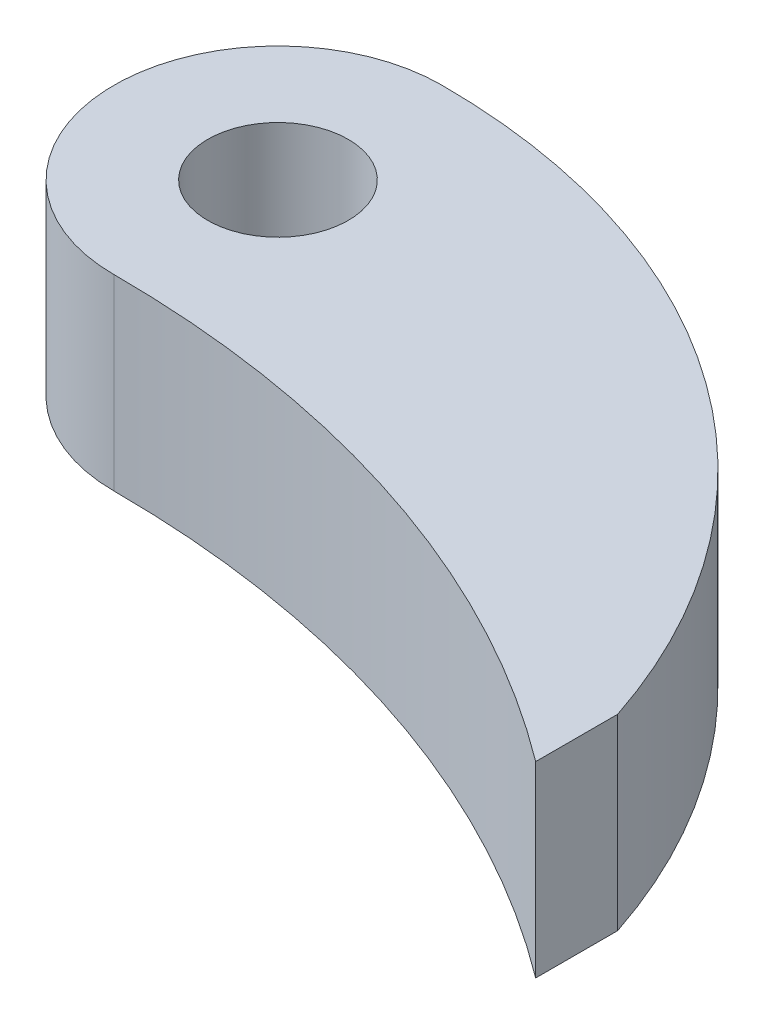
ISO-10303-21;
HEADER;
FILE_DESCRIPTION(('STEP AP214'),'2;1');
FILE_NAME('part.step','',(''),(''),'','','');
FILE_SCHEMA(('AUTOMOTIVE_DESIGN { 1 0 10303 214 1 1 1 1 }'));
ENDSEC;
DATA;
#1=APPLICATION_CONTEXT('core data for automotive mechanical design processes');
#2=APPLICATION_PROTOCOL_DEFINITION('international standard','automotive_design',2000,#1);
#3=PRODUCT_CONTEXT('',#1,'mechanical');
#4=PRODUCT('Part','Part','',(#3));
#5=PRODUCT_RELATED_PRODUCT_CATEGORY('part','',(#4));
#6=PRODUCT_DEFINITION_FORMATION('','',#4);
#7=PRODUCT_DEFINITION_CONTEXT('part definition',#1,'design');
#8=PRODUCT_DEFINITION('design','',#6,#7);
#9=PRODUCT_DEFINITION_SHAPE('','',#8);
#10=(LENGTH_UNIT() NAMED_UNIT(*) SI_UNIT(.MILLI.,.METRE.));
#11=(NAMED_UNIT(*) PLANE_ANGLE_UNIT() SI_UNIT($,.RADIAN.));
#12=(NAMED_UNIT(*) SI_UNIT($,.STERADIAN.) SOLID_ANGLE_UNIT());
#13=UNCERTAINTY_MEASURE_WITH_UNIT(LENGTH_MEASURE(1.E-05),#10,'distance_accuracy_value','');
#14=(GEOMETRIC_REPRESENTATION_CONTEXT(3) GLOBAL_UNCERTAINTY_ASSIGNED_CONTEXT((#13)) GLOBAL_UNIT_ASSIGNED_CONTEXT((#10,
#11,#12)) REPRESENTATION_CONTEXT('',''));
#15=CARTESIAN_POINT('',(0.,0.,0.));
#16=DIRECTION('',(0.,0.,1.));
#17=DIRECTION('',(1.,0.,0.));
#18=AXIS2_PLACEMENT_3D('',#15,#16,#17);
#19=CARTESIAN_POINT('',(-37.5,8.,-18.25));
#20=DIRECTION('',(0.,-1.,0.));
#21=DIRECTION('',(0.,0.,-1.));
#22=AXIS2_PLACEMENT_3D('',#19,#20,#21);
#23=PLANE('',#22);
#24=CARTESIAN_POINT('',(-37.5,8.,-18.25));
#25=DIRECTION('',(0.,1.,0.));
#26=DIRECTION('',(0.,0.,-1.));
#27=AXIS2_PLACEMENT_3D('',#24,#25,#26);
#28=CIRCLE('',#27,3.5);
#29=CARTESIAN_POINT('',(-37.5,8.,-21.75));
#30=VERTEX_POINT('',#29);
#31=CARTESIAN_POINT('',(-37.5,8.,-14.75));
#32=VERTEX_POINT('',#31);
#33=EDGE_CURVE('E84',#30,#32,#28,.T.);
#34=ORIENTED_EDGE('',*,*,#33,.T.);
#35=CARTESIAN_POINT('',(-37.5,8.,7.74999999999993));
#36=DIRECTION('',(0.,-1.,0.));
#37=DIRECTION('',(0.,0.,-1.));
#38=AXIS2_PLACEMENT_3D('',#35,#36,#37);
#39=CIRCLE('',#38,22.4999999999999);
#40=CARTESIAN_POINT('',(-24.,8.,-10.25));
#41=VERTEX_POINT('',#40);
#42=EDGE_CURVE('E79',#32,#41,#39,.T.);
#43=ORIENTED_EDGE('',*,*,#42,.T.);
#44=DIRECTION('',(0.,0.,-1.));
#45=VECTOR('',#44,1.);
#46=CARTESIAN_POINT('',(-24.,8.,-10.25));
#47=LINE('',#46,#45);
#48=CARTESIAN_POINT('',(-24.,8.,-12.));
#49=VERTEX_POINT('',#48);
#50=EDGE_CURVE('E82',#41,#49,#47,.T.);
#51=ORIENTED_EDGE('',*,*,#50,.T.);
#52=CARTESIAN_POINT('',(-37.5,8.,-7.52884615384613));
#53=DIRECTION('',(0.,1.,0.));
#54=DIRECTION('',(0.,0.,-1.));
#55=AXIS2_PLACEMENT_3D('',#52,#53,#54);
#56=CIRCLE('',#55,14.2211538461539);
#57=EDGE_CURVE('E49',#49,#30,#56,.T.);
#58=ORIENTED_EDGE('',*,*,#57,.T.);
#59=EDGE_LOOP('',(#34,#43,#51,#58));
#60=FACE_BOUND('',#59,.T.);
#61=CARTESIAN_POINT('',(-37.5,8.,-18.25));
#62=DIRECTION('',(0.,1.,0.));
#63=DIRECTION('',(0.,0.,-1.));
#64=AXIS2_PLACEMENT_3D('',#61,#62,#63);
#65=CIRCLE('',#64,1.50000000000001);
#66=CARTESIAN_POINT('',(-37.5,8.,-19.75));
#67=VERTEX_POINT('',#66);
#68=EDGE_CURVE('E99',#67,#67,#65,.T.);
#69=ORIENTED_EDGE('',*,*,#68,.F.);
#70=EDGE_LOOP('',(#69));
#71=FACE_BOUND('',#70,.T.);
#72=ADVANCED_FACE('F32',(#60,#71),#23,.F.);
#73=CARTESIAN_POINT('',(-37.5,4.,-18.25));
#74=DIRECTION('',(0.,-1.,0.));
#75=DIRECTION('',(0.,0.,-1.));
#76=AXIS2_PLACEMENT_3D('',#73,#74,#75);
#77=PLANE('',#76);
#78=CARTESIAN_POINT('',(-37.5,4.,-18.25));
#79=DIRECTION('',(0.,1.,0.));
#80=DIRECTION('',(0.,0.,-1.));
#81=AXIS2_PLACEMENT_3D('',#78,#79,#80);
#82=CIRCLE('',#81,3.5);
#83=CARTESIAN_POINT('',(-37.5,4.,-21.75));
#84=VERTEX_POINT('',#83);
#85=CARTESIAN_POINT('',(-37.5,4.,-14.75));
#86=VERTEX_POINT('',#85);
#87=EDGE_CURVE('E96',#84,#86,#82,.T.);
#88=ORIENTED_EDGE('',*,*,#87,.F.);
#89=CARTESIAN_POINT('',(-37.5,4.,-7.52884615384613));
#90=DIRECTION('',(0.,1.,0.));
#91=DIRECTION('',(0.,0.,-1.));
#92=AXIS2_PLACEMENT_3D('',#89,#90,#91);
#93=CIRCLE('',#92,14.2211538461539);
#94=CARTESIAN_POINT('',(-24.,4.,-12.));
#95=VERTEX_POINT('',#94);
#96=EDGE_CURVE('E72',#95,#84,#93,.T.);
#97=ORIENTED_EDGE('',*,*,#96,.F.);
#98=DIRECTION('',(0.,0.,-1.));
#99=VECTOR('',#98,1.);
#100=CARTESIAN_POINT('',(-24.,4.,-10.25));
#101=LINE('',#100,#99);
#102=CARTESIAN_POINT('',(-24.,4.,-10.25));
#103=VERTEX_POINT('',#102);
#104=EDGE_CURVE('E66',#103,#95,#101,.T.);
#105=ORIENTED_EDGE('',*,*,#104,.F.);
#106=CARTESIAN_POINT('',(-37.5,4.,7.74999999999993));
#107=DIRECTION('',(0.,-1.,0.));
#108=DIRECTION('',(0.,0.,-1.));
#109=AXIS2_PLACEMENT_3D('',#106,#107,#108);
#110=CIRCLE('',#109,22.4999999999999);
#111=EDGE_CURVE('E88',#86,#103,#110,.T.);
#112=ORIENTED_EDGE('',*,*,#111,.F.);
#113=EDGE_LOOP('',(#88,#97,#105,#112));
#114=FACE_BOUND('',#113,.T.);
#115=CARTESIAN_POINT('',(-37.5,4.,-18.25));
#116=DIRECTION('',(0.,1.,0.));
#117=DIRECTION('',(0.,0.,-1.));
#118=AXIS2_PLACEMENT_3D('',#115,#116,#117);
#119=CIRCLE('',#118,1.50000000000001);
#120=CARTESIAN_POINT('',(-37.5,4.,-19.75));
#121=VERTEX_POINT('',#120);
#122=EDGE_CURVE('E111',#121,#121,#119,.T.);
#123=ORIENTED_EDGE('',*,*,#122,.T.);
#124=EDGE_LOOP('',(#123));
#125=FACE_BOUND('',#124,.T.);
#126=ADVANCED_FACE('F107',(#114,#125),#77,.T.);
#127=CARTESIAN_POINT('',(-37.5,8.,-18.25));
#128=DIRECTION('',(0.,-1.,0.));
#129=DIRECTION('',(0.,0.,-1.));
#130=AXIS2_PLACEMENT_3D('',#127,#128,#129);
#131=CYLINDRICAL_SURFACE('',#130,3.5);
#132=ORIENTED_EDGE('',*,*,#87,.T.);
#133=DIRECTION('',(0.,-1.,0.));
#134=VECTOR('',#133,1.);
#135=CARTESIAN_POINT('',(-37.5,8.,-14.75));
#136=LINE('',#135,#134);
#137=EDGE_CURVE('E11',#32,#86,#136,.T.);
#138=ORIENTED_EDGE('',*,*,#137,.F.);
#139=ORIENTED_EDGE('',*,*,#33,.F.);
#140=DIRECTION('',(0.,-1.,0.));
#141=VECTOR('',#140,1.);
#142=CARTESIAN_POINT('',(-37.5,8.,-21.75));
#143=LINE('',#142,#141);
#144=EDGE_CURVE('E92',#30,#84,#143,.T.);
#145=ORIENTED_EDGE('',*,*,#144,.T.);
#146=EDGE_LOOP('',(#132,#138,#139,#145));
#147=FACE_BOUND('',#146,.T.);
#148=ADVANCED_FACE('F34',(#147),#131,.T.);
#149=CARTESIAN_POINT('',(-37.5,8.,7.74999999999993));
#150=DIRECTION('',(0.,-1.,0.));
#151=DIRECTION('',(0.,0.,-1.));
#152=AXIS2_PLACEMENT_3D('',#149,#150,#151);
#153=CYLINDRICAL_SURFACE('',#152,22.4999999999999);
#154=ORIENTED_EDGE('',*,*,#111,.T.);
#155=DIRECTION('',(0.,-1.,0.));
#156=VECTOR('',#155,1.);
#157=CARTESIAN_POINT('',(-24.,8.,-10.25));
#158=LINE('',#157,#156);
#159=EDGE_CURVE('E41',#41,#103,#158,.T.);
#160=ORIENTED_EDGE('',*,*,#159,.F.);
#161=ORIENTED_EDGE('',*,*,#42,.F.);
#162=ORIENTED_EDGE('',*,*,#137,.T.);
#163=EDGE_LOOP('',(#154,#160,#161,#162));
#164=FACE_BOUND('',#163,.T.);
#165=ADVANCED_FACE('F87',(#164),#153,.F.);
#166=CARTESIAN_POINT('',(-24.,8.,-10.25));
#167=DIRECTION('',(-1.,0.,0.));
#168=DIRECTION('',(0.,0.,1.));
#169=AXIS2_PLACEMENT_3D('',#166,#167,#168);
#170=PLANE('',#169);
#171=ORIENTED_EDGE('',*,*,#104,.T.);
#172=DIRECTION('',(0.,-1.,0.));
#173=VECTOR('',#172,1.);
#174=CARTESIAN_POINT('',(-24.,8.,-12.));
#175=LINE('',#174,#173);
#176=EDGE_CURVE('E89',#49,#95,#175,.T.);
#177=ORIENTED_EDGE('',*,*,#176,.F.);
#178=ORIENTED_EDGE('',*,*,#50,.F.);
#179=ORIENTED_EDGE('',*,*,#159,.T.);
#180=EDGE_LOOP('',(#171,#177,#178,#179));
#181=FACE_BOUND('',#180,.T.);
#182=ADVANCED_FACE('F90',(#181),#170,.F.);
#183=CARTESIAN_POINT('',(-37.5,8.,-7.52884615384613));
#184=DIRECTION('',(0.,-1.,0.));
#185=DIRECTION('',(0.,0.,-1.));
#186=AXIS2_PLACEMENT_3D('',#183,#184,#185);
#187=CYLINDRICAL_SURFACE('',#186,14.2211538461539);
#188=ORIENTED_EDGE('',*,*,#96,.T.);
#189=ORIENTED_EDGE('',*,*,#144,.F.);
#190=ORIENTED_EDGE('',*,*,#57,.F.);
#191=ORIENTED_EDGE('',*,*,#176,.T.);
#192=EDGE_LOOP('',(#188,#189,#190,#191));
#193=FACE_BOUND('',#192,.T.);
#194=ADVANCED_FACE('F104',(#193),#187,.T.);
#195=CARTESIAN_POINT('',(-37.5,8.,-18.25));
#196=DIRECTION('',(0.,-1.,0.));
#197=DIRECTION('',(0.,0.,-1.));
#198=AXIS2_PLACEMENT_3D('',#195,#196,#197);
#199=CYLINDRICAL_SURFACE('',#198,1.50000000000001);
#200=ORIENTED_EDGE('',*,*,#68,.T.);
#201=EDGE_LOOP('',(#200));
#202=FACE_BOUND('',#201,.T.);
#203=ORIENTED_EDGE('',*,*,#122,.F.);
#204=EDGE_LOOP('',(#203));
#205=FACE_BOUND('',#204,.T.);
#206=ADVANCED_FACE('F117',(#202,#205),#199,.F.);
#207=CLOSED_SHELL('',(#72,#126,#148,#165,#182,#194,#206));
#208=MANIFOLD_SOLID_BREP('B2',#207);
#209=ADVANCED_BREP_SHAPE_REPRESENTATION('',(#18,#208),#14);
#210=SHAPE_DEFINITION_REPRESENTATION(#9,#209);
ENDSEC;
END-ISO-10303-21;
